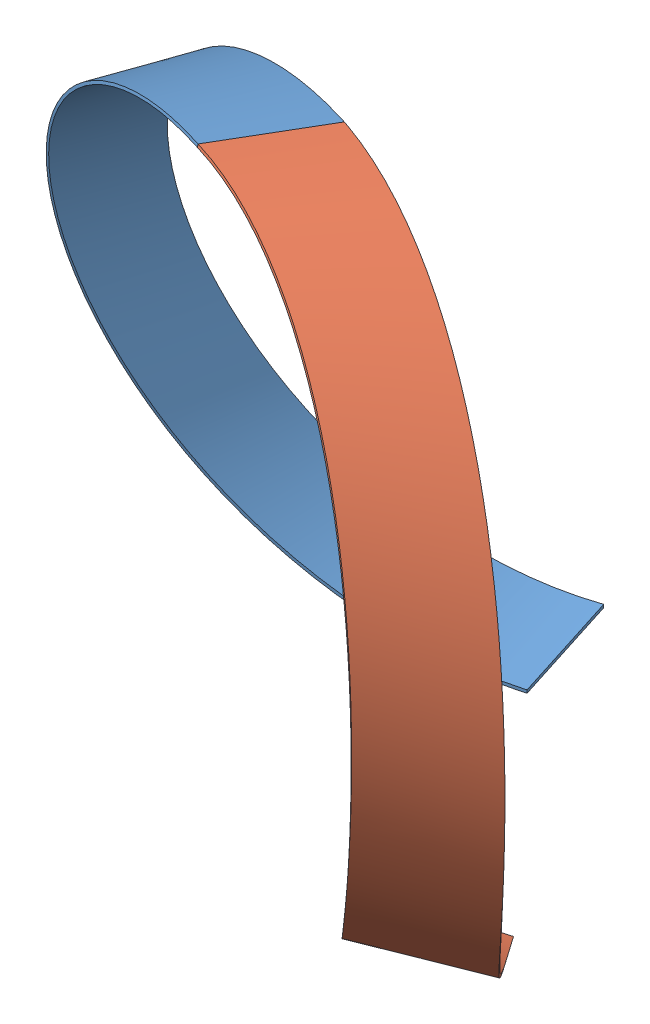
SolidWorks assembly Baugruppe1.sldasm, configuration 01 (file format 4100). Lengths in mm.
Overall size (126.05 122.18 125.12).
2 component instances, 2 part files, 3 mates.
Components (placement in the parent):
- KN1-5-1: KN1-5.SLDPRT [01] at origin size (53.75 102.62 68.95)
- KN1-6-1: KN1-6.SLDPRT [01] at (23.4705 -11.8991 26.3153) x (0.820392 0.094932 0.563865) z (-0.563865 0.298033 0.770216) size (53.75 101.62 68.95)
Mates (geometry in assembly coordinates):
- Deckungsgleich1: coincident: point of KN1-5-1; point of KN1-6-1
- Deckungsgleich2: coincident: point of KN1-5-1; point of KN1-6-1
- Deckungsgleich3: coincident: point of KN1-5-1; point of KN1-6-1
